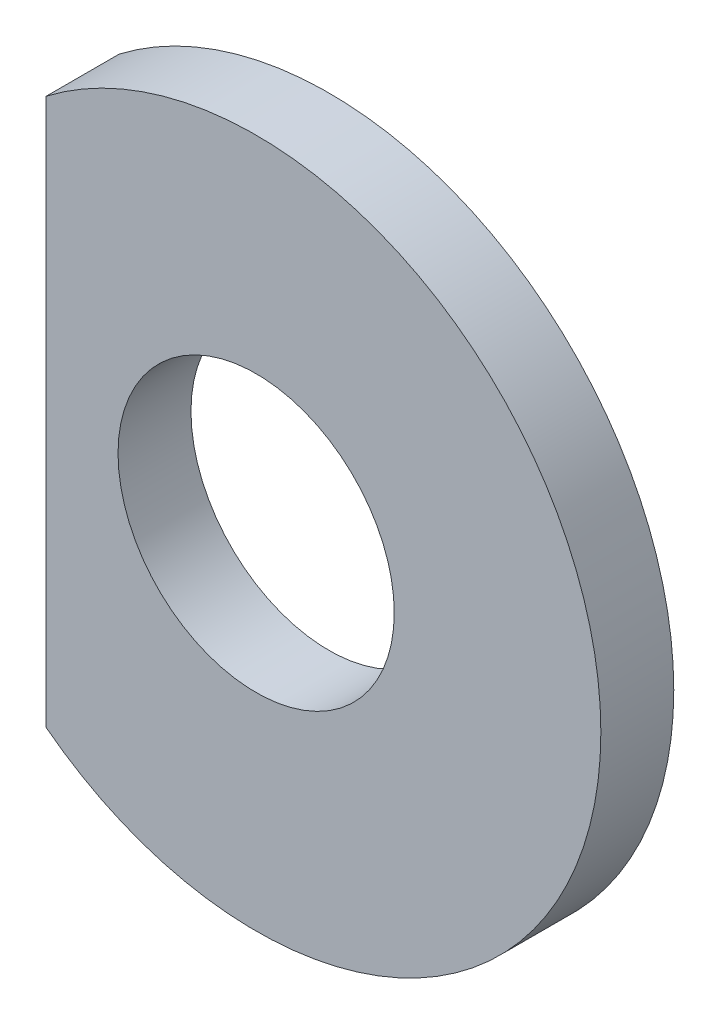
from build123d import *

# Parameters (mm, degrees)
SKETCH1_R      = 1.5875
EXTRUDE1_DEPTH = 0.8382


with BuildPart() as part:
    # Sketch1 → Extrude1 (new body)
    with BuildSketch(Plane.XY):
        with BuildLine():
            Line((-2.413, 3.142935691), (-2.413, -3.142935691))
            ThreePointArc((-2.413, -3.142935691), (3.9624, 0), (-2.413, 3.142935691))
        make_face()
        Circle(SKETCH1_R, mode=Mode.SUBTRACT)
    extrude(amount=-EXTRUDE1_DEPTH)


solid = part.part
